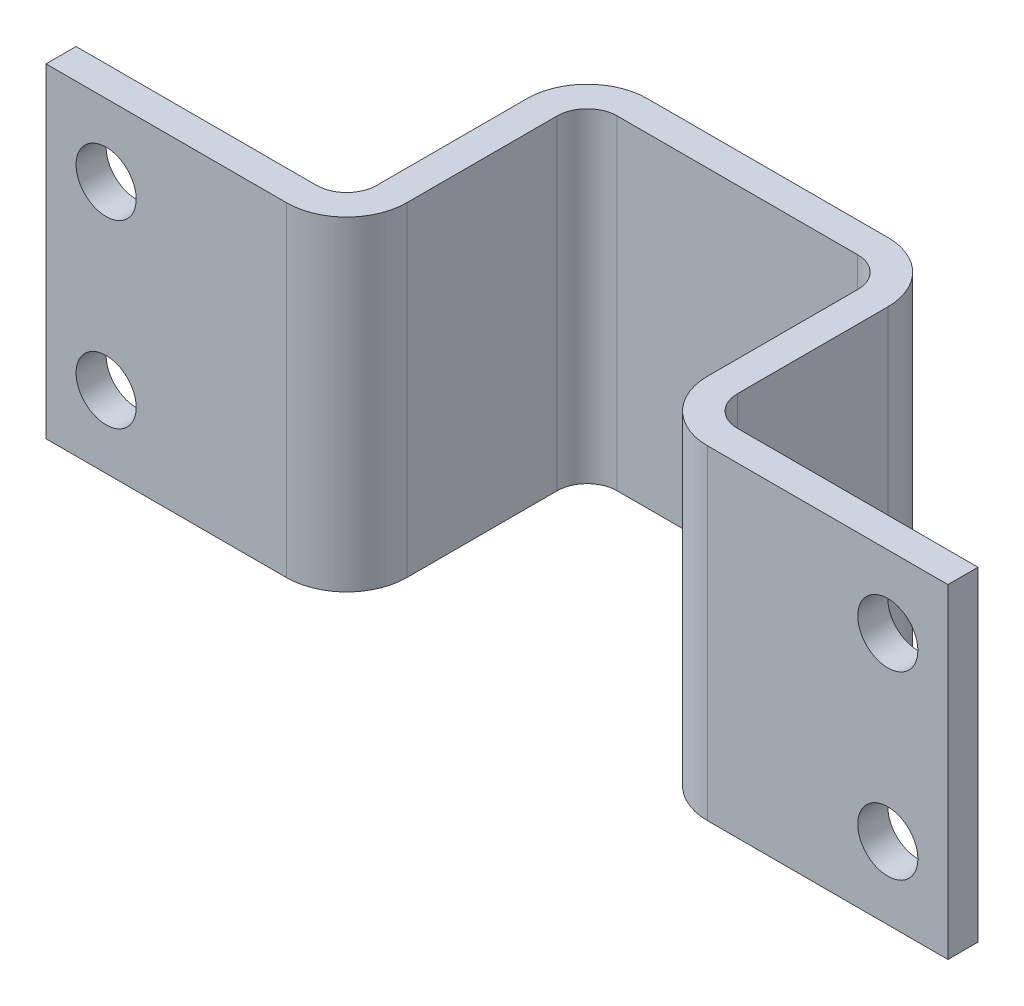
ISO-10303-21;
HEADER;
FILE_DESCRIPTION(('STEP AP214'),'2;1');
FILE_NAME('part.step','',(''),(''),'','','');
FILE_SCHEMA(('AUTOMOTIVE_DESIGN { 1 0 10303 214 1 1 1 1 }'));
ENDSEC;
DATA;
#1=APPLICATION_CONTEXT('core data for automotive mechanical design processes');
#2=APPLICATION_PROTOCOL_DEFINITION('international standard','automotive_design',2000,#1);
#3=PRODUCT_CONTEXT('',#1,'mechanical');
#4=PRODUCT('Part','Part','',(#3));
#5=PRODUCT_RELATED_PRODUCT_CATEGORY('part','',(#4));
#6=PRODUCT_DEFINITION_FORMATION('','',#4);
#7=PRODUCT_DEFINITION_CONTEXT('part definition',#1,'design');
#8=PRODUCT_DEFINITION('design','',#6,#7);
#9=PRODUCT_DEFINITION_SHAPE('','',#8);
#10=(LENGTH_UNIT() NAMED_UNIT(*) SI_UNIT(.MILLI.,.METRE.));
#11=(NAMED_UNIT(*) PLANE_ANGLE_UNIT() SI_UNIT($,.RADIAN.));
#12=(NAMED_UNIT(*) SI_UNIT($,.STERADIAN.) SOLID_ANGLE_UNIT());
#13=UNCERTAINTY_MEASURE_WITH_UNIT(LENGTH_MEASURE(1.E-05),#10,'distance_accuracy_value','');
#14=(GEOMETRIC_REPRESENTATION_CONTEXT(3) GLOBAL_UNCERTAINTY_ASSIGNED_CONTEXT((#13)) GLOBAL_UNIT_ASSIGNED_CONTEXT((#10,
#11,#12)) REPRESENTATION_CONTEXT('',''));
#15=CARTESIAN_POINT('',(0.,0.,0.));
#16=DIRECTION('',(0.,0.,1.));
#17=DIRECTION('',(1.,0.,0.));
#18=AXIS2_PLACEMENT_3D('',#15,#16,#17);
#19=CARTESIAN_POINT('',(35.,54.,5.));
#20=DIRECTION('',(0.,0.,-1.));
#21=DIRECTION('',(-1.,0.,0.));
#22=AXIS2_PLACEMENT_3D('',#19,#20,#21);
#23=PLANE('',#22);
#24=CARTESIAN_POINT('',(65.,12.,5.));
#25=DIRECTION('',(0.,0.,1.));
#26=DIRECTION('',(1.,0.,0.));
#27=AXIS2_PLACEMENT_3D('',#24,#25,#26);
#28=CIRCLE('',#27,5.);
#29=CARTESIAN_POINT('',(70.,12.,5.));
#30=VERTEX_POINT('',#29);
#31=EDGE_CURVE('E371',#30,#30,#28,.T.);
#32=ORIENTED_EDGE('',*,*,#31,.F.);
#33=EDGE_LOOP('',(#32));
#34=FACE_BOUND('',#33,.T.);
#35=CARTESIAN_POINT('',(65.,42.,5.));
#36=DIRECTION('',(0.,0.,1.));
#37=DIRECTION('',(1.,0.,0.));
#38=AXIS2_PLACEMENT_3D('',#35,#36,#37);
#39=CIRCLE('',#38,5.00000000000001);
#40=CARTESIAN_POINT('',(70.,42.,5.));
#41=VERTEX_POINT('',#40);
#42=EDGE_CURVE('E204',#41,#41,#39,.T.);
#43=ORIENTED_EDGE('',*,*,#42,.F.);
#44=EDGE_LOOP('',(#43));
#45=FACE_BOUND('',#44,.T.);
#46=DIRECTION('',(1.,0.,0.));
#47=VECTOR('',#46,1.);
#48=CARTESIAN_POINT('',(35.,0.,5.));
#49=LINE('',#48,#47);
#50=CARTESIAN_POINT('',(35.,0.,5.));
#51=VERTEX_POINT('',#50);
#52=CARTESIAN_POINT('',(75.,0.,5.));
#53=VERTEX_POINT('',#52);
#54=EDGE_CURVE('E200',#51,#53,#49,.T.);
#55=ORIENTED_EDGE('',*,*,#54,.T.);
#56=DIRECTION('',(0.,-1.,0.));
#57=VECTOR('',#56,1.);
#58=CARTESIAN_POINT('',(75.,54.,5.));
#59=LINE('',#58,#57);
#60=CARTESIAN_POINT('',(75.,54.,5.));
#61=VERTEX_POINT('',#60);
#62=EDGE_CURVE('E11',#61,#53,#59,.T.);
#63=ORIENTED_EDGE('',*,*,#62,.F.);
#64=DIRECTION('',(1.,0.,0.));
#65=VECTOR('',#64,1.);
#66=CARTESIAN_POINT('',(35.,54.,5.));
#67=LINE('',#66,#65);
#68=CARTESIAN_POINT('',(35.,54.,5.));
#69=VERTEX_POINT('',#68);
#70=EDGE_CURVE('E125',#69,#61,#67,.T.);
#71=ORIENTED_EDGE('',*,*,#70,.F.);
#72=DIRECTION('',(0.,-1.,0.));
#73=VECTOR('',#72,1.);
#74=CARTESIAN_POINT('',(35.,54.,5.));
#75=LINE('',#74,#73);
#76=EDGE_CURVE('E196',#69,#51,#75,.T.);
#77=ORIENTED_EDGE('',*,*,#76,.T.);
#78=EDGE_LOOP('',(#55,#63,#71,#77));
#79=FACE_BOUND('',#78,.T.);
#80=ADVANCED_FACE('F33',(#34,#45,#79),#23,.F.);
#81=CARTESIAN_POINT('',(75.,54.,0.));
#82=DIRECTION('',(1.,0.,0.));
#83=DIRECTION('',(0.,0.,-1.));
#84=AXIS2_PLACEMENT_3D('',#81,#82,#83);
#85=PLANE('',#84);
#86=DIRECTION('',(0.,0.,1.));
#87=VECTOR('',#86,1.);
#88=CARTESIAN_POINT('',(75.,0.,0.));
#89=LINE('',#88,#87);
#90=CARTESIAN_POINT('',(75.,0.,0.));
#91=VERTEX_POINT('',#90);
#92=EDGE_CURVE('E203',#91,#53,#89,.T.);
#93=ORIENTED_EDGE('',*,*,#92,.F.);
#94=DIRECTION('',(0.,-1.,0.));
#95=VECTOR('',#94,1.);
#96=CARTESIAN_POINT('',(75.,54.,0.));
#97=LINE('',#96,#95);
#98=CARTESIAN_POINT('',(75.,54.,0.));
#99=VERTEX_POINT('',#98);
#100=EDGE_CURVE('E41',#99,#91,#97,.T.);
#101=ORIENTED_EDGE('',*,*,#100,.F.);
#102=DIRECTION('',(0.,0.,1.));
#103=VECTOR('',#102,1.);
#104=CARTESIAN_POINT('',(75.,54.,0.));
#105=LINE('',#104,#103);
#106=EDGE_CURVE('E306',#99,#61,#105,.T.);
#107=ORIENTED_EDGE('',*,*,#106,.T.);
#108=ORIENTED_EDGE('',*,*,#62,.T.);
#109=EDGE_LOOP('',(#93,#101,#107,#108));
#110=FACE_BOUND('',#109,.T.);
#111=ADVANCED_FACE('F293',(#110),#85,.T.);
#112=CARTESIAN_POINT('',(35.,54.,0.));
#113=DIRECTION('',(0.,0.,-1.));
#114=DIRECTION('',(-1.,0.,0.));
#115=AXIS2_PLACEMENT_3D('',#112,#113,#114);
#116=PLANE('',#115);
#117=CARTESIAN_POINT('',(65.,12.,0.));
#118=DIRECTION('',(0.,0.,-1.));
#119=DIRECTION('',(-1.,0.,0.));
#120=AXIS2_PLACEMENT_3D('',#117,#118,#119);
#121=CIRCLE('',#120,5.);
#122=CARTESIAN_POINT('',(60.,12.,0.));
#123=VERTEX_POINT('',#122);
#124=EDGE_CURVE('E392',#123,#123,#121,.F.);
#125=ORIENTED_EDGE('',*,*,#124,.T.);
#126=EDGE_LOOP('',(#125));
#127=FACE_BOUND('',#126,.T.);
#128=CARTESIAN_POINT('',(65.,42.,0.));
#129=DIRECTION('',(0.,0.,-1.));
#130=DIRECTION('',(-1.,0.,0.));
#131=AXIS2_PLACEMENT_3D('',#128,#129,#130);
#132=CIRCLE('',#131,5.00000000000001);
#133=CARTESIAN_POINT('',(60.,42.,0.));
#134=VERTEX_POINT('',#133);
#135=EDGE_CURVE('E375',#134,#134,#132,.F.);
#136=ORIENTED_EDGE('',*,*,#135,.T.);
#137=EDGE_LOOP('',(#136));
#138=FACE_BOUND('',#137,.T.);
#139=DIRECTION('',(1.,0.,0.));
#140=VECTOR('',#139,1.);
#141=CARTESIAN_POINT('',(35.,0.,0.));
#142=LINE('',#141,#140);
#143=CARTESIAN_POINT('',(35.,0.,0.));
#144=VERTEX_POINT('',#143);
#145=EDGE_CURVE('E207',#144,#91,#142,.T.);
#146=ORIENTED_EDGE('',*,*,#145,.F.);
#147=DIRECTION('',(0.,-1.,0.));
#148=VECTOR('',#147,1.);
#149=CARTESIAN_POINT('',(35.,54.,0.));
#150=LINE('',#149,#148);
#151=CARTESIAN_POINT('',(35.,54.,0.));
#152=VERTEX_POINT('',#151);
#153=EDGE_CURVE('E283',#152,#144,#150,.T.);
#154=ORIENTED_EDGE('',*,*,#153,.F.);
#155=DIRECTION('',(1.,0.,0.));
#156=VECTOR('',#155,1.);
#157=CARTESIAN_POINT('',(35.,54.,0.));
#158=LINE('',#157,#156);
#159=EDGE_CURVE('E290',#152,#99,#158,.T.);
#160=ORIENTED_EDGE('',*,*,#159,.T.);
#161=ORIENTED_EDGE('',*,*,#100,.T.);
#162=EDGE_LOOP('',(#146,#154,#160,#161));
#163=FACE_BOUND('',#162,.T.);
#164=ADVANCED_FACE('F288',(#127,#138,#163),#116,.T.);
#165=CARTESIAN_POINT('',(35.,54.,-5.));
#166=DIRECTION('',(0.,-1.,0.));
#167=DIRECTION('',(0.,0.,-1.));
#168=AXIS2_PLACEMENT_3D('',#165,#166,#167);
#169=CYLINDRICAL_SURFACE('',#168,5.);
#170=CARTESIAN_POINT('',(35.,0.,-5.));
#171=DIRECTION('',(0.,1.,0.));
#172=DIRECTION('',(0.,0.,1.));
#173=AXIS2_PLACEMENT_3D('',#170,#171,#172);
#174=CIRCLE('',#173,5.);
#175=CARTESIAN_POINT('',(30.,0.,-5.));
#176=VERTEX_POINT('',#175);
#177=EDGE_CURVE('E210',#176,#144,#174,.T.);
#178=ORIENTED_EDGE('',*,*,#177,.F.);
#179=DIRECTION('',(0.,-1.,0.));
#180=VECTOR('',#179,1.);
#181=CARTESIAN_POINT('',(30.,54.,-5.));
#182=LINE('',#181,#180);
#183=CARTESIAN_POINT('',(30.,54.,-5.));
#184=VERTEX_POINT('',#183);
#185=EDGE_CURVE('E281',#184,#176,#182,.T.);
#186=ORIENTED_EDGE('',*,*,#185,.F.);
#187=CARTESIAN_POINT('',(35.,54.,-5.));
#188=DIRECTION('',(0.,1.,0.));
#189=DIRECTION('',(0.,0.,1.));
#190=AXIS2_PLACEMENT_3D('',#187,#188,#189);
#191=CIRCLE('',#190,5.);
#192=EDGE_CURVE('E303',#184,#152,#191,.T.);
#193=ORIENTED_EDGE('',*,*,#192,.T.);
#194=ORIENTED_EDGE('',*,*,#153,.T.);
#195=EDGE_LOOP('',(#178,#186,#193,#194));
#196=FACE_BOUND('',#195,.T.);
#197=ADVANCED_FACE('F300',(#196),#169,.F.);
#198=CARTESIAN_POINT('',(30.,54.,-30.));
#199=DIRECTION('',(1.,0.,0.));
#200=DIRECTION('',(0.,0.,-1.));
#201=AXIS2_PLACEMENT_3D('',#198,#199,#200);
#202=PLANE('',#201);
#203=DIRECTION('',(0.,0.,1.));
#204=VECTOR('',#203,1.);
#205=CARTESIAN_POINT('',(30.,0.,-30.));
#206=LINE('',#205,#204);
#207=CARTESIAN_POINT('',(30.,0.,-30.));
#208=VERTEX_POINT('',#207);
#209=EDGE_CURVE('E213',#208,#176,#206,.T.);
#210=ORIENTED_EDGE('',*,*,#209,.F.);
#211=DIRECTION('',(0.,-1.,0.));
#212=VECTOR('',#211,1.);
#213=CARTESIAN_POINT('',(30.,54.,-30.));
#214=LINE('',#213,#212);
#215=CARTESIAN_POINT('',(30.,54.,-30.));
#216=VERTEX_POINT('',#215);
#217=EDGE_CURVE('E279',#216,#208,#214,.T.);
#218=ORIENTED_EDGE('',*,*,#217,.F.);
#219=DIRECTION('',(0.,0.,1.));
#220=VECTOR('',#219,1.);
#221=CARTESIAN_POINT('',(30.,54.,-30.));
#222=LINE('',#221,#220);
#223=EDGE_CURVE('E308',#216,#184,#222,.T.);
#224=ORIENTED_EDGE('',*,*,#223,.T.);
#225=ORIENTED_EDGE('',*,*,#185,.T.);
#226=EDGE_LOOP('',(#210,#218,#224,#225));
#227=FACE_BOUND('',#226,.T.);
#228=ADVANCED_FACE('F569',(#227),#202,.T.);
#229=CARTESIAN_POINT('',(20.,54.,-30.));
#230=DIRECTION('',(0.,-1.,0.));
#231=DIRECTION('',(0.,0.,-1.));
#232=AXIS2_PLACEMENT_3D('',#229,#230,#231);
#233=CYLINDRICAL_SURFACE('',#232,10.);
#234=CARTESIAN_POINT('',(20.,0.,-30.));
#235=DIRECTION('',(0.,-1.,0.));
#236=DIRECTION('',(0.,0.,-1.));
#237=AXIS2_PLACEMENT_3D('',#234,#235,#236);
#238=CIRCLE('',#237,10.);
#239=CARTESIAN_POINT('',(20.,0.,-40.));
#240=VERTEX_POINT('',#239);
#241=EDGE_CURVE('E216',#240,#208,#238,.T.);
#242=ORIENTED_EDGE('',*,*,#241,.F.);
#243=DIRECTION('',(0.,-1.,0.));
#244=VECTOR('',#243,1.);
#245=CARTESIAN_POINT('',(20.,54.,-40.));
#246=LINE('',#245,#244);
#247=CARTESIAN_POINT('',(20.,54.,-40.));
#248=VERTEX_POINT('',#247);
#249=EDGE_CURVE('E277',#248,#240,#246,.T.);
#250=ORIENTED_EDGE('',*,*,#249,.F.);
#251=CARTESIAN_POINT('',(20.,54.,-30.));
#252=DIRECTION('',(0.,-1.,0.));
#253=DIRECTION('',(0.,0.,-1.));
#254=AXIS2_PLACEMENT_3D('',#251,#252,#253);
#255=CIRCLE('',#254,10.);
#256=EDGE_CURVE('E314',#248,#216,#255,.T.);
#257=ORIENTED_EDGE('',*,*,#256,.T.);
#258=ORIENTED_EDGE('',*,*,#217,.T.);
#259=EDGE_LOOP('',(#242,#250,#257,#258));
#260=FACE_BOUND('',#259,.T.);
#261=ADVANCED_FACE('F560',(#260),#233,.T.);
#262=CARTESIAN_POINT('',(-20.,54.,-40.));
#263=DIRECTION('',(0.,0.,-1.));
#264=DIRECTION('',(-1.,0.,0.));
#265=AXIS2_PLACEMENT_3D('',#262,#263,#264);
#266=PLANE('',#265);
#267=DIRECTION('',(1.,0.,0.));
#268=VECTOR('',#267,1.);
#269=CARTESIAN_POINT('',(-20.,0.,-40.));
#270=LINE('',#269,#268);
#271=CARTESIAN_POINT('',(-20.,0.,-40.));
#272=VERTEX_POINT('',#271);
#273=EDGE_CURVE('E219',#272,#240,#270,.T.);
#274=ORIENTED_EDGE('',*,*,#273,.F.);
#275=DIRECTION('',(0.,-1.,0.));
#276=VECTOR('',#275,1.);
#277=CARTESIAN_POINT('',(-20.,54.,-40.));
#278=LINE('',#277,#276);
#279=CARTESIAN_POINT('',(-20.,54.,-40.));
#280=VERTEX_POINT('',#279);
#281=EDGE_CURVE('E275',#280,#272,#278,.T.);
#282=ORIENTED_EDGE('',*,*,#281,.F.);
#283=DIRECTION('',(1.,0.,0.));
#284=VECTOR('',#283,1.);
#285=CARTESIAN_POINT('',(-20.,54.,-40.));
#286=LINE('',#285,#284);
#287=EDGE_CURVE('E317',#280,#248,#286,.T.);
#288=ORIENTED_EDGE('',*,*,#287,.T.);
#289=ORIENTED_EDGE('',*,*,#249,.T.);
#290=EDGE_LOOP('',(#274,#282,#288,#289));
#291=FACE_BOUND('',#290,.T.);
#292=ADVANCED_FACE('F551',(#291),#266,.T.);
#293=CARTESIAN_POINT('',(-20.,54.,-30.));
#294=DIRECTION('',(0.,-1.,0.));
#295=DIRECTION('',(0.,0.,-1.));
#296=AXIS2_PLACEMENT_3D('',#293,#294,#295);
#297=CYLINDRICAL_SURFACE('',#296,10.);
#298=CARTESIAN_POINT('',(-20.,0.,-30.));
#299=DIRECTION('',(0.,-1.,0.));
#300=DIRECTION('',(0.,0.,-1.));
#301=AXIS2_PLACEMENT_3D('',#298,#299,#300);
#302=CIRCLE('',#301,10.);
#303=CARTESIAN_POINT('',(-30.,0.,-30.));
#304=VERTEX_POINT('',#303);
#305=EDGE_CURVE('E222',#304,#272,#302,.T.);
#306=ORIENTED_EDGE('',*,*,#305,.F.);
#307=DIRECTION('',(0.,-1.,0.));
#308=VECTOR('',#307,1.);
#309=CARTESIAN_POINT('',(-30.,54.,-30.));
#310=LINE('',#309,#308);
#311=CARTESIAN_POINT('',(-30.,54.,-30.));
#312=VERTEX_POINT('',#311);
#313=EDGE_CURVE('E273',#312,#304,#310,.T.);
#314=ORIENTED_EDGE('',*,*,#313,.F.);
#315=CARTESIAN_POINT('',(-20.,54.,-30.));
#316=DIRECTION('',(0.,-1.,0.));
#317=DIRECTION('',(0.,0.,-1.));
#318=AXIS2_PLACEMENT_3D('',#315,#316,#317);
#319=CIRCLE('',#318,10.);
#320=EDGE_CURVE('E320',#312,#280,#319,.T.);
#321=ORIENTED_EDGE('',*,*,#320,.T.);
#322=ORIENTED_EDGE('',*,*,#281,.T.);
#323=EDGE_LOOP('',(#306,#314,#321,#322));
#324=FACE_BOUND('',#323,.T.);
#325=ADVANCED_FACE('F542',(#324),#297,.T.);
#326=CARTESIAN_POINT('',(-30.,54.,-5.));
#327=DIRECTION('',(-1.,0.,0.));
#328=DIRECTION('',(0.,0.,1.));
#329=AXIS2_PLACEMENT_3D('',#326,#327,#328);
#330=PLANE('',#329);
#331=DIRECTION('',(0.,0.,-1.));
#332=VECTOR('',#331,1.);
#333=CARTESIAN_POINT('',(-30.,0.,-5.));
#334=LINE('',#333,#332);
#335=CARTESIAN_POINT('',(-30.,0.,-5.));
#336=VERTEX_POINT('',#335);
#337=EDGE_CURVE('E225',#336,#304,#334,.T.);
#338=ORIENTED_EDGE('',*,*,#337,.F.);
#339=DIRECTION('',(0.,-1.,0.));
#340=VECTOR('',#339,1.);
#341=CARTESIAN_POINT('',(-30.,54.,-5.));
#342=LINE('',#341,#340);
#343=CARTESIAN_POINT('',(-30.,54.,-5.));
#344=VERTEX_POINT('',#343);
#345=EDGE_CURVE('E271',#344,#336,#342,.T.);
#346=ORIENTED_EDGE('',*,*,#345,.F.);
#347=DIRECTION('',(0.,0.,-1.));
#348=VECTOR('',#347,1.);
#349=CARTESIAN_POINT('',(-30.,54.,-5.));
#350=LINE('',#349,#348);
#351=EDGE_CURVE('E323',#344,#312,#350,.T.);
#352=ORIENTED_EDGE('',*,*,#351,.T.);
#353=ORIENTED_EDGE('',*,*,#313,.T.);
#354=EDGE_LOOP('',(#338,#346,#352,#353));
#355=FACE_BOUND('',#354,.T.);
#356=ADVANCED_FACE('F533',(#355),#330,.T.);
#357=CARTESIAN_POINT('',(-35.,54.,-5.));
#358=DIRECTION('',(0.,-1.,0.));
#359=DIRECTION('',(0.,0.,-1.));
#360=AXIS2_PLACEMENT_3D('',#357,#358,#359);
#361=CYLINDRICAL_SURFACE('',#360,5.);
#362=CARTESIAN_POINT('',(-35.,0.,-5.));
#363=DIRECTION('',(0.,1.,0.));
#364=DIRECTION('',(0.,0.,1.));
#365=AXIS2_PLACEMENT_3D('',#362,#363,#364);
#366=CIRCLE('',#365,5.);
#367=CARTESIAN_POINT('',(-35.,0.,0.));
#368=VERTEX_POINT('',#367);
#369=EDGE_CURVE('E228',#368,#336,#366,.T.);
#370=ORIENTED_EDGE('',*,*,#369,.F.);
#371=DIRECTION('',(0.,-1.,0.));
#372=VECTOR('',#371,1.);
#373=CARTESIAN_POINT('',(-35.,54.,0.));
#374=LINE('',#373,#372);
#375=CARTESIAN_POINT('',(-35.,54.,0.));
#376=VERTEX_POINT('',#375);
#377=EDGE_CURVE('E269',#376,#368,#374,.T.);
#378=ORIENTED_EDGE('',*,*,#377,.F.);
#379=CARTESIAN_POINT('',(-35.,54.,-5.));
#380=DIRECTION('',(0.,1.,0.));
#381=DIRECTION('',(0.,0.,1.));
#382=AXIS2_PLACEMENT_3D('',#379,#380,#381);
#383=CIRCLE('',#382,5.);
#384=EDGE_CURVE('E326',#376,#344,#383,.T.);
#385=ORIENTED_EDGE('',*,*,#384,.T.);
#386=ORIENTED_EDGE('',*,*,#345,.T.);
#387=EDGE_LOOP('',(#370,#378,#385,#386));
#388=FACE_BOUND('',#387,.T.);
#389=ADVANCED_FACE('F524',(#388),#361,.F.);
#390=CARTESIAN_POINT('',(-75.,54.,0.));
#391=DIRECTION('',(0.,0.,-1.));
#392=DIRECTION('',(-1.,0.,0.));
#393=AXIS2_PLACEMENT_3D('',#390,#391,#392);
#394=PLANE('',#393);
#395=CARTESIAN_POINT('',(-65.,42.,0.));
#396=DIRECTION('',(0.,0.,-1.));
#397=DIRECTION('',(-1.,0.,0.));
#398=AXIS2_PLACEMENT_3D('',#395,#396,#397);
#399=CIRCLE('',#398,5.00000000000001);
#400=CARTESIAN_POINT('',(-70.,42.,0.));
#401=VERTEX_POINT('',#400);
#402=EDGE_CURVE('E380',#401,#401,#399,.F.);
#403=ORIENTED_EDGE('',*,*,#402,.T.);
#404=EDGE_LOOP('',(#403));
#405=FACE_BOUND('',#404,.T.);
#406=CARTESIAN_POINT('',(-65.,12.,0.));
#407=DIRECTION('',(0.,0.,-1.));
#408=DIRECTION('',(-1.,0.,0.));
#409=AXIS2_PLACEMENT_3D('',#406,#407,#408);
#410=CIRCLE('',#409,5.);
#411=CARTESIAN_POINT('',(-70.,12.,0.));
#412=VERTEX_POINT('',#411);
#413=EDGE_CURVE('E386',#412,#412,#410,.F.);
#414=ORIENTED_EDGE('',*,*,#413,.T.);
#415=EDGE_LOOP('',(#414));
#416=FACE_BOUND('',#415,.T.);
#417=DIRECTION('',(1.,0.,0.));
#418=VECTOR('',#417,1.);
#419=CARTESIAN_POINT('',(-75.,0.,0.));
#420=LINE('',#419,#418);
#421=CARTESIAN_POINT('',(-75.,0.,0.));
#422=VERTEX_POINT('',#421);
#423=EDGE_CURVE('E231',#422,#368,#420,.T.);
#424=ORIENTED_EDGE('',*,*,#423,.F.);
#425=DIRECTION('',(0.,-1.,0.));
#426=VECTOR('',#425,1.);
#427=CARTESIAN_POINT('',(-75.,54.,0.));
#428=LINE('',#427,#426);
#429=CARTESIAN_POINT('',(-75.,54.,0.));
#430=VERTEX_POINT('',#429);
#431=EDGE_CURVE('E267',#430,#422,#428,.T.);
#432=ORIENTED_EDGE('',*,*,#431,.F.);
#433=DIRECTION('',(1.,0.,0.));
#434=VECTOR('',#433,1.);
#435=CARTESIAN_POINT('',(-75.,54.,0.));
#436=LINE('',#435,#434);
#437=EDGE_CURVE('E329',#430,#376,#436,.T.);
#438=ORIENTED_EDGE('',*,*,#437,.T.);
#439=ORIENTED_EDGE('',*,*,#377,.T.);
#440=EDGE_LOOP('',(#424,#432,#438,#439));
#441=FACE_BOUND('',#440,.T.);
#442=ADVANCED_FACE('F515',(#405,#416,#441),#394,.T.);
#443=CARTESIAN_POINT('',(-75.,54.,5.));
#444=DIRECTION('',(-1.,0.,0.));
#445=DIRECTION('',(0.,0.,1.));
#446=AXIS2_PLACEMENT_3D('',#443,#444,#445);
#447=PLANE('',#446);
#448=DIRECTION('',(0.,0.,-1.));
#449=VECTOR('',#448,1.);
#450=CARTESIAN_POINT('',(-75.,0.,5.));
#451=LINE('',#450,#449);
#452=CARTESIAN_POINT('',(-75.,0.,5.));
#453=VERTEX_POINT('',#452);
#454=EDGE_CURVE('E234',#453,#422,#451,.T.);
#455=ORIENTED_EDGE('',*,*,#454,.F.);
#456=DIRECTION('',(0.,-1.,0.));
#457=VECTOR('',#456,1.);
#458=CARTESIAN_POINT('',(-75.,54.,5.));
#459=LINE('',#458,#457);
#460=CARTESIAN_POINT('',(-75.,54.,5.));
#461=VERTEX_POINT('',#460);
#462=EDGE_CURVE('E265',#461,#453,#459,.T.);
#463=ORIENTED_EDGE('',*,*,#462,.F.);
#464=DIRECTION('',(0.,0.,-1.));
#465=VECTOR('',#464,1.);
#466=CARTESIAN_POINT('',(-75.,54.,5.));
#467=LINE('',#466,#465);
#468=EDGE_CURVE('E332',#461,#430,#467,.T.);
#469=ORIENTED_EDGE('',*,*,#468,.T.);
#470=ORIENTED_EDGE('',*,*,#431,.T.);
#471=EDGE_LOOP('',(#455,#463,#469,#470));
#472=FACE_BOUND('',#471,.T.);
#473=ADVANCED_FACE('F506',(#472),#447,.T.);
#474=CARTESIAN_POINT('',(-75.,54.,5.));
#475=DIRECTION('',(0.,0.,-1.));
#476=DIRECTION('',(-1.,0.,0.));
#477=AXIS2_PLACEMENT_3D('',#474,#475,#476);
#478=PLANE('',#477);
#479=CARTESIAN_POINT('',(-65.,42.,5.));
#480=DIRECTION('',(0.,0.,1.));
#481=DIRECTION('',(-1.,0.,0.));
#482=AXIS2_PLACEMENT_3D('',#479,#480,#481);
#483=CIRCLE('',#482,5.00000000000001);
#484=CARTESIAN_POINT('',(-70.,42.,5.));
#485=VERTEX_POINT('',#484);
#486=EDGE_CURVE('E383',#485,#485,#483,.T.);
#487=ORIENTED_EDGE('',*,*,#486,.F.);
#488=EDGE_LOOP('',(#487));
#489=FACE_BOUND('',#488,.T.);
#490=CARTESIAN_POINT('',(-65.,12.,5.));
#491=DIRECTION('',(0.,0.,1.));
#492=DIRECTION('',(-1.,0.,0.));
#493=AXIS2_PLACEMENT_3D('',#490,#491,#492);
#494=CIRCLE('',#493,5.);
#495=CARTESIAN_POINT('',(-70.,12.,5.));
#496=VERTEX_POINT('',#495);
#497=EDGE_CURVE('E389',#496,#496,#494,.T.);
#498=ORIENTED_EDGE('',*,*,#497,.F.);
#499=EDGE_LOOP('',(#498));
#500=FACE_BOUND('',#499,.T.);
#501=DIRECTION('',(1.,0.,0.));
#502=VECTOR('',#501,1.);
#503=CARTESIAN_POINT('',(-75.,0.,5.));
#504=LINE('',#503,#502);
#505=CARTESIAN_POINT('',(-35.,0.,5.));
#506=VERTEX_POINT('',#505);
#507=EDGE_CURVE('E237',#453,#506,#504,.T.);
#508=ORIENTED_EDGE('',*,*,#507,.T.);
#509=DIRECTION('',(0.,-1.,0.));
#510=VECTOR('',#509,1.);
#511=CARTESIAN_POINT('',(-35.,54.,5.));
#512=LINE('',#511,#510);
#513=CARTESIAN_POINT('',(-35.,54.,5.));
#514=VERTEX_POINT('',#513);
#515=EDGE_CURVE('E262',#514,#506,#512,.T.);
#516=ORIENTED_EDGE('',*,*,#515,.F.);
#517=DIRECTION('',(1.,0.,0.));
#518=VECTOR('',#517,1.);
#519=CARTESIAN_POINT('',(-75.,54.,5.));
#520=LINE('',#519,#518);
#521=EDGE_CURVE('E335',#461,#514,#520,.T.);
#522=ORIENTED_EDGE('',*,*,#521,.F.);
#523=ORIENTED_EDGE('',*,*,#462,.T.);
#524=EDGE_LOOP('',(#508,#516,#522,#523));
#525=FACE_BOUND('',#524,.T.);
#526=ADVANCED_FACE('F497',(#489,#500,#525),#478,.F.);
#527=CARTESIAN_POINT('',(-35.,54.,-5.));
#528=DIRECTION('',(0.,-1.,0.));
#529=DIRECTION('',(0.,0.,-1.));
#530=AXIS2_PLACEMENT_3D('',#527,#528,#529);
#531=CYLINDRICAL_SURFACE('',#530,10.);
#532=CARTESIAN_POINT('',(-35.,0.,-5.));
#533=DIRECTION('',(0.,1.,0.));
#534=DIRECTION('',(1.,0.,0.));
#535=AXIS2_PLACEMENT_3D('',#532,#533,#534);
#536=CIRCLE('',#535,10.);
#537=CARTESIAN_POINT('',(-25.,0.,-5.));
#538=VERTEX_POINT('',#537);
#539=EDGE_CURVE('E239',#506,#538,#536,.T.);
#540=ORIENTED_EDGE('',*,*,#539,.T.);
#541=DIRECTION('',(0.,-1.,0.));
#542=VECTOR('',#541,1.);
#543=CARTESIAN_POINT('',(-25.,54.,-5.));
#544=LINE('',#543,#542);
#545=CARTESIAN_POINT('',(-25.,54.,-5.));
#546=VERTEX_POINT('',#545);
#547=EDGE_CURVE('E259',#546,#538,#544,.T.);
#548=ORIENTED_EDGE('',*,*,#547,.F.);
#549=CARTESIAN_POINT('',(-35.,54.,-5.));
#550=DIRECTION('',(0.,1.,0.));
#551=DIRECTION('',(1.,0.,0.));
#552=AXIS2_PLACEMENT_3D('',#549,#550,#551);
#553=CIRCLE('',#552,10.);
#554=EDGE_CURVE('E337',#514,#546,#553,.T.);
#555=ORIENTED_EDGE('',*,*,#554,.F.);
#556=ORIENTED_EDGE('',*,*,#515,.T.);
#557=EDGE_LOOP('',(#540,#548,#555,#556));
#558=FACE_BOUND('',#557,.T.);
#559=ADVANCED_FACE('F488',(#558),#531,.T.);
#560=CARTESIAN_POINT('',(-25.,54.,-5.));
#561=DIRECTION('',(-1.,0.,0.));
#562=DIRECTION('',(0.,0.,1.));
#563=AXIS2_PLACEMENT_3D('',#560,#561,#562);
#564=PLANE('',#563);
#565=DIRECTION('',(0.,0.,-1.));
#566=VECTOR('',#565,1.);
#567=CARTESIAN_POINT('',(-25.,0.,-5.));
#568=LINE('',#567,#566);
#569=CARTESIAN_POINT('',(-25.,0.,-30.));
#570=VERTEX_POINT('',#569);
#571=EDGE_CURVE('E241',#538,#570,#568,.T.);
#572=ORIENTED_EDGE('',*,*,#571,.T.);
#573=DIRECTION('',(0.,-1.,0.));
#574=VECTOR('',#573,1.);
#575=CARTESIAN_POINT('',(-25.,54.,-30.));
#576=LINE('',#575,#574);
#577=CARTESIAN_POINT('',(-25.,54.,-30.));
#578=VERTEX_POINT('',#577);
#579=EDGE_CURVE('E256',#578,#570,#576,.T.);
#580=ORIENTED_EDGE('',*,*,#579,.F.);
#581=DIRECTION('',(0.,0.,-1.));
#582=VECTOR('',#581,1.);
#583=CARTESIAN_POINT('',(-25.,54.,-5.));
#584=LINE('',#583,#582);
#585=EDGE_CURVE('E339',#546,#578,#584,.T.);
#586=ORIENTED_EDGE('',*,*,#585,.F.);
#587=ORIENTED_EDGE('',*,*,#547,.T.);
#588=EDGE_LOOP('',(#572,#580,#586,#587));
#589=FACE_BOUND('',#588,.T.);
#590=ADVANCED_FACE('F480',(#589),#564,.F.);
#591=CARTESIAN_POINT('',(-20.,54.,-30.));
#592=DIRECTION('',(0.,-1.,0.));
#593=DIRECTION('',(0.,0.,-1.));
#594=AXIS2_PLACEMENT_3D('',#591,#592,#593);
#595=CYLINDRICAL_SURFACE('',#594,5.);
#596=CARTESIAN_POINT('',(-20.,0.,-30.));
#597=DIRECTION('',(0.,1.,0.));
#598=DIRECTION('',(1.,0.,0.));
#599=AXIS2_PLACEMENT_3D('',#596,#597,#598);
#600=CIRCLE('',#599,5.);
#601=CARTESIAN_POINT('',(-20.,0.,-35.));
#602=VERTEX_POINT('',#601);
#603=EDGE_CURVE('E243',#570,#602,#600,.F.);
#604=ORIENTED_EDGE('',*,*,#603,.T.);
#605=DIRECTION('',(0.,-1.,0.));
#606=VECTOR('',#605,1.);
#607=CARTESIAN_POINT('',(-20.,54.,-35.));
#608=LINE('',#607,#606);
#609=CARTESIAN_POINT('',(-20.,54.,-35.));
#610=VERTEX_POINT('',#609);
#611=EDGE_CURVE('E253',#610,#602,#608,.T.);
#612=ORIENTED_EDGE('',*,*,#611,.F.);
#613=CARTESIAN_POINT('',(-20.,54.,-30.));
#614=DIRECTION('',(0.,1.,0.));
#615=DIRECTION('',(1.,0.,0.));
#616=AXIS2_PLACEMENT_3D('',#613,#614,#615);
#617=CIRCLE('',#616,5.);
#618=EDGE_CURVE('E341',#578,#610,#617,.F.);
#619=ORIENTED_EDGE('',*,*,#618,.F.);
#620=ORIENTED_EDGE('',*,*,#579,.T.);
#621=EDGE_LOOP('',(#604,#612,#619,#620));
#622=FACE_BOUND('',#621,.T.);
#623=ADVANCED_FACE('F347',(#622),#595,.F.);
#624=CARTESIAN_POINT('',(-20.,54.,-35.));
#625=DIRECTION('',(0.,0.,-1.));
#626=DIRECTION('',(-1.,0.,0.));
#627=AXIS2_PLACEMENT_3D('',#624,#625,#626);
#628=PLANE('',#627);
#629=DIRECTION('',(1.,0.,0.));
#630=VECTOR('',#629,1.);
#631=CARTESIAN_POINT('',(-20.,0.,-35.));
#632=LINE('',#631,#630);
#633=CARTESIAN_POINT('',(20.,0.,-35.));
#634=VERTEX_POINT('',#633);
#635=EDGE_CURVE('E245',#602,#634,#632,.T.);
#636=ORIENTED_EDGE('',*,*,#635,.T.);
#637=DIRECTION('',(0.,-1.,0.));
#638=VECTOR('',#637,1.);
#639=CARTESIAN_POINT('',(20.,54.,-35.));
#640=LINE('',#639,#638);
#641=CARTESIAN_POINT('',(20.,54.,-35.));
#642=VERTEX_POINT('',#641);
#643=EDGE_CURVE('E191',#642,#634,#640,.T.);
#644=ORIENTED_EDGE('',*,*,#643,.F.);
#645=DIRECTION('',(1.,0.,0.));
#646=VECTOR('',#645,1.);
#647=CARTESIAN_POINT('',(-20.,54.,-35.));
#648=LINE('',#647,#646);
#649=EDGE_CURVE('E182',#610,#642,#648,.T.);
#650=ORIENTED_EDGE('',*,*,#649,.F.);
#651=ORIENTED_EDGE('',*,*,#611,.T.);
#652=EDGE_LOOP('',(#636,#644,#650,#651));
#653=FACE_BOUND('',#652,.T.);
#654=ADVANCED_FACE('F351',(#653),#628,.F.);
#655=CARTESIAN_POINT('',(20.,54.,-30.));
#656=DIRECTION('',(0.,-1.,0.));
#657=DIRECTION('',(0.,0.,-1.));
#658=AXIS2_PLACEMENT_3D('',#655,#656,#657);
#659=CYLINDRICAL_SURFACE('',#658,5.);
#660=CARTESIAN_POINT('',(20.,0.,-30.));
#661=DIRECTION('',(0.,1.,0.));
#662=DIRECTION('',(1.,0.,0.));
#663=AXIS2_PLACEMENT_3D('',#660,#661,#662);
#664=CIRCLE('',#663,5.);
#665=CARTESIAN_POINT('',(25.,0.,-30.));
#666=VERTEX_POINT('',#665);
#667=EDGE_CURVE('E190',#634,#666,#664,.F.);
#668=ORIENTED_EDGE('',*,*,#667,.T.);
#669=DIRECTION('',(0.,-1.,0.));
#670=VECTOR('',#669,1.);
#671=CARTESIAN_POINT('',(25.,54.,-30.));
#672=LINE('',#671,#670);
#673=CARTESIAN_POINT('',(25.,54.,-30.));
#674=VERTEX_POINT('',#673);
#675=EDGE_CURVE('E187',#674,#666,#672,.T.);
#676=ORIENTED_EDGE('',*,*,#675,.F.);
#677=CARTESIAN_POINT('',(20.,54.,-30.));
#678=DIRECTION('',(0.,1.,0.));
#679=DIRECTION('',(1.,0.,0.));
#680=AXIS2_PLACEMENT_3D('',#677,#678,#679);
#681=CIRCLE('',#680,5.);
#682=EDGE_CURVE('E176',#642,#674,#681,.F.);
#683=ORIENTED_EDGE('',*,*,#682,.F.);
#684=ORIENTED_EDGE('',*,*,#643,.T.);
#685=EDGE_LOOP('',(#668,#676,#683,#684));
#686=FACE_BOUND('',#685,.T.);
#687=ADVANCED_FACE('F188',(#686),#659,.F.);
#688=CARTESIAN_POINT('',(25.,54.,-30.));
#689=DIRECTION('',(1.,0.,0.));
#690=DIRECTION('',(0.,0.,-1.));
#691=AXIS2_PLACEMENT_3D('',#688,#689,#690);
#692=PLANE('',#691);
#693=DIRECTION('',(0.,0.,-1.));
#694=VECTOR('',#693,1.);
#695=CARTESIAN_POINT('',(25.,0.,-30.));
#696=LINE('',#695,#694);
#697=CARTESIAN_POINT('',(25.,0.,-5.));
#698=VERTEX_POINT('',#697);
#699=EDGE_CURVE('E113',#666,#698,#696,.F.);
#700=ORIENTED_EDGE('',*,*,#699,.T.);
#701=DIRECTION('',(0.,-1.,0.));
#702=VECTOR('',#701,1.);
#703=CARTESIAN_POINT('',(25.,54.,-5.));
#704=LINE('',#703,#702);
#705=CARTESIAN_POINT('',(25.,54.,-5.));
#706=VERTEX_POINT('',#705);
#707=EDGE_CURVE('E192',#706,#698,#704,.T.);
#708=ORIENTED_EDGE('',*,*,#707,.F.);
#709=DIRECTION('',(0.,0.,-1.));
#710=VECTOR('',#709,1.);
#711=CARTESIAN_POINT('',(25.,54.,-30.));
#712=LINE('',#711,#710);
#713=EDGE_CURVE('E180',#674,#706,#712,.F.);
#714=ORIENTED_EDGE('',*,*,#713,.F.);
#715=ORIENTED_EDGE('',*,*,#675,.T.);
#716=EDGE_LOOP('',(#700,#708,#714,#715));
#717=FACE_BOUND('',#716,.T.);
#718=ADVANCED_FACE('F194',(#717),#692,.F.);
#719=CARTESIAN_POINT('',(35.,54.,-5.));
#720=DIRECTION('',(0.,-1.,0.));
#721=DIRECTION('',(0.,0.,-1.));
#722=AXIS2_PLACEMENT_3D('',#719,#720,#721);
#723=CYLINDRICAL_SURFACE('',#722,10.);
#724=CARTESIAN_POINT('',(35.,0.,-5.));
#725=DIRECTION('',(0.,1.,0.));
#726=DIRECTION('',(1.,0.,0.));
#727=AXIS2_PLACEMENT_3D('',#724,#725,#726);
#728=CIRCLE('',#727,10.);
#729=EDGE_CURVE('E119',#698,#51,#728,.T.);
#730=ORIENTED_EDGE('',*,*,#729,.T.);
#731=ORIENTED_EDGE('',*,*,#76,.F.);
#732=CARTESIAN_POINT('',(35.,54.,-5.));
#733=DIRECTION('',(0.,1.,0.));
#734=DIRECTION('',(1.,0.,0.));
#735=AXIS2_PLACEMENT_3D('',#732,#733,#734);
#736=CIRCLE('',#735,10.);
#737=EDGE_CURVE('E49',#706,#69,#736,.T.);
#738=ORIENTED_EDGE('',*,*,#737,.F.);
#739=ORIENTED_EDGE('',*,*,#707,.T.);
#740=EDGE_LOOP('',(#730,#731,#738,#739));
#741=FACE_BOUND('',#740,.T.);
#742=ADVANCED_FACE('F353',(#741),#723,.T.);
#743=CARTESIAN_POINT('',(35.,54.,-5.));
#744=DIRECTION('',(0.,1.,0.));
#745=DIRECTION('',(1.,0.,0.));
#746=AXIS2_PLACEMENT_3D('',#743,#744,#745);
#747=PLANE('',#746);
#748=ORIENTED_EDGE('',*,*,#70,.T.);
#749=ORIENTED_EDGE('',*,*,#106,.F.);
#750=ORIENTED_EDGE('',*,*,#159,.F.);
#751=ORIENTED_EDGE('',*,*,#192,.F.);
#752=ORIENTED_EDGE('',*,*,#223,.F.);
#753=ORIENTED_EDGE('',*,*,#256,.F.);
#754=ORIENTED_EDGE('',*,*,#287,.F.);
#755=ORIENTED_EDGE('',*,*,#320,.F.);
#756=ORIENTED_EDGE('',*,*,#351,.F.);
#757=ORIENTED_EDGE('',*,*,#384,.F.);
#758=ORIENTED_EDGE('',*,*,#437,.F.);
#759=ORIENTED_EDGE('',*,*,#468,.F.);
#760=ORIENTED_EDGE('',*,*,#521,.T.);
#761=ORIENTED_EDGE('',*,*,#554,.T.);
#762=ORIENTED_EDGE('',*,*,#585,.T.);
#763=ORIENTED_EDGE('',*,*,#618,.T.);
#764=ORIENTED_EDGE('',*,*,#649,.T.);
#765=ORIENTED_EDGE('',*,*,#682,.T.);
#766=ORIENTED_EDGE('',*,*,#713,.T.);
#767=ORIENTED_EDGE('',*,*,#737,.T.);
#768=EDGE_LOOP('',(#748,#749,#750,#751,#752,#753,#754,#755,#756,#757,#758,#759,#760,#761,#762,
#763,#764,#765,#766,#767));
#769=FACE_BOUND('',#768,.T.);
#770=ADVANCED_FACE('F178',(#769),#747,.T.);
#771=CARTESIAN_POINT('',(35.,0.,-5.));
#772=DIRECTION('',(0.,1.,0.));
#773=DIRECTION('',(1.,0.,0.));
#774=AXIS2_PLACEMENT_3D('',#771,#772,#773);
#775=PLANE('',#774);
#776=ORIENTED_EDGE('',*,*,#54,.F.);
#777=ORIENTED_EDGE('',*,*,#729,.F.);
#778=ORIENTED_EDGE('',*,*,#699,.F.);
#779=ORIENTED_EDGE('',*,*,#667,.F.);
#780=ORIENTED_EDGE('',*,*,#635,.F.);
#781=ORIENTED_EDGE('',*,*,#603,.F.);
#782=ORIENTED_EDGE('',*,*,#571,.F.);
#783=ORIENTED_EDGE('',*,*,#539,.F.);
#784=ORIENTED_EDGE('',*,*,#507,.F.);
#785=ORIENTED_EDGE('',*,*,#454,.T.);
#786=ORIENTED_EDGE('',*,*,#423,.T.);
#787=ORIENTED_EDGE('',*,*,#369,.T.);
#788=ORIENTED_EDGE('',*,*,#337,.T.);
#789=ORIENTED_EDGE('',*,*,#305,.T.);
#790=ORIENTED_EDGE('',*,*,#273,.T.);
#791=ORIENTED_EDGE('',*,*,#241,.T.);
#792=ORIENTED_EDGE('',*,*,#209,.T.);
#793=ORIENTED_EDGE('',*,*,#177,.T.);
#794=ORIENTED_EDGE('',*,*,#145,.T.);
#795=ORIENTED_EDGE('',*,*,#92,.T.);
#796=EDGE_LOOP('',(#776,#777,#778,#779,#780,#781,#782,#783,#784,#785,#786,#787,#788,#789,#790,
#791,#792,#793,#794,#795));
#797=FACE_BOUND('',#796,.T.);
#798=ADVANCED_FACE('F296',(#797),#775,.F.);
#799=CARTESIAN_POINT('',(-65.,12.,-40.001));
#800=DIRECTION('',(0.,0.,1.));
#801=DIRECTION('',(1.,0.,0.));
#802=AXIS2_PLACEMENT_3D('',#799,#800,#801);
#803=CYLINDRICAL_SURFACE('',#802,5.);
#804=ORIENTED_EDGE('',*,*,#413,.F.);
#805=EDGE_LOOP('',(#804));
#806=FACE_BOUND('',#805,.T.);
#807=ORIENTED_EDGE('',*,*,#497,.T.);
#808=EDGE_LOOP('',(#807));
#809=FACE_BOUND('',#808,.T.);
#810=ADVANCED_FACE('F409',(#806,#809),#803,.F.);
#811=CARTESIAN_POINT('',(-65.,42.,-40.001));
#812=DIRECTION('',(0.,0.,1.));
#813=DIRECTION('',(1.,0.,0.));
#814=AXIS2_PLACEMENT_3D('',#811,#812,#813);
#815=CYLINDRICAL_SURFACE('',#814,5.00000000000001);
#816=ORIENTED_EDGE('',*,*,#402,.F.);
#817=EDGE_LOOP('',(#816));
#818=FACE_BOUND('',#817,.T.);
#819=ORIENTED_EDGE('',*,*,#486,.T.);
#820=EDGE_LOOP('',(#819));
#821=FACE_BOUND('',#820,.T.);
#822=ADVANCED_FACE('F404',(#818,#821),#815,.F.);
#823=CARTESIAN_POINT('',(65.,42.,-40.001));
#824=DIRECTION('',(0.,0.,1.));
#825=DIRECTION('',(1.,0.,0.));
#826=AXIS2_PLACEMENT_3D('',#823,#824,#825);
#827=CYLINDRICAL_SURFACE('',#826,5.00000000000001);
#828=ORIENTED_EDGE('',*,*,#135,.F.);
#829=EDGE_LOOP('',(#828));
#830=FACE_BOUND('',#829,.T.);
#831=ORIENTED_EDGE('',*,*,#42,.T.);
#832=EDGE_LOOP('',(#831));
#833=FACE_BOUND('',#832,.T.);
#834=ADVANCED_FACE('F398',(#830,#833),#827,.F.);
#835=CARTESIAN_POINT('',(65.,12.,-40.001));
#836=DIRECTION('',(0.,0.,1.));
#837=DIRECTION('',(1.,0.,0.));
#838=AXIS2_PLACEMENT_3D('',#835,#836,#837);
#839=CYLINDRICAL_SURFACE('',#838,5.);
#840=ORIENTED_EDGE('',*,*,#124,.F.);
#841=EDGE_LOOP('',(#840));
#842=FACE_BOUND('',#841,.T.);
#843=ORIENTED_EDGE('',*,*,#31,.T.);
#844=EDGE_LOOP('',(#843));
#845=FACE_BOUND('',#844,.T.);
#846=ADVANCED_FACE('F396',(#842,#845),#839,.F.);
#847=CLOSED_SHELL('',(#80,#111,#164,#197,#228,#261,#292,#325,#356,#389,#442,#473,#526,#559,#590,
#623,#654,#687,#718,#742,#770,#798,#810,#822,#834,#846));
#848=MANIFOLD_SOLID_BREP('B2',#847);
#849=ADVANCED_BREP_SHAPE_REPRESENTATION('',(#18,#848),#14);
#850=SHAPE_DEFINITION_REPRESENTATION(#9,#849);
ENDSEC;
END-ISO-10303-21;
